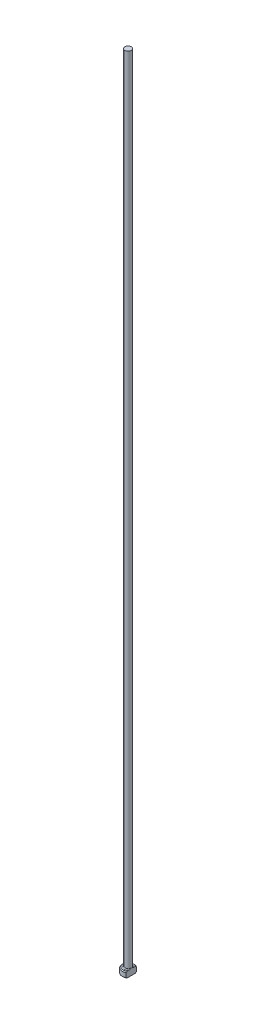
ISO-10303-21;
HEADER;
FILE_DESCRIPTION(('STEP AP214'),'2;1');
FILE_NAME('part.step','',(''),(''),'','','');
FILE_SCHEMA(('AUTOMOTIVE_DESIGN { 1 0 10303 214 1 1 1 1 }'));
ENDSEC;
DATA;
#1=APPLICATION_CONTEXT('core data for automotive mechanical design processes');
#2=APPLICATION_PROTOCOL_DEFINITION('international standard','automotive_design',2000,#1);
#3=PRODUCT_CONTEXT('',#1,'mechanical');
#4=PRODUCT('Part','Part','',(#3));
#5=PRODUCT_RELATED_PRODUCT_CATEGORY('part','',(#4));
#6=PRODUCT_DEFINITION_FORMATION('','',#4);
#7=PRODUCT_DEFINITION_CONTEXT('part definition',#1,'design');
#8=PRODUCT_DEFINITION('design','',#6,#7);
#9=PRODUCT_DEFINITION_SHAPE('','',#8);
#10=(LENGTH_UNIT() NAMED_UNIT(*) SI_UNIT(.MILLI.,.METRE.));
#11=(NAMED_UNIT(*) PLANE_ANGLE_UNIT() SI_UNIT($,.RADIAN.));
#12=(NAMED_UNIT(*) SI_UNIT($,.STERADIAN.) SOLID_ANGLE_UNIT());
#13=UNCERTAINTY_MEASURE_WITH_UNIT(LENGTH_MEASURE(1.E-05),#10,'distance_accuracy_value','');
#14=(GEOMETRIC_REPRESENTATION_CONTEXT(3) GLOBAL_UNCERTAINTY_ASSIGNED_CONTEXT((#13)) GLOBAL_UNIT_ASSIGNED_CONTEXT((#10,
#11,#12)) REPRESENTATION_CONTEXT('',''));
#15=CARTESIAN_POINT('',(0.,0.,0.));
#16=DIRECTION('',(0.,0.,1.));
#17=DIRECTION('',(1.,0.,0.));
#18=AXIS2_PLACEMENT_3D('',#15,#16,#17);
#19=CARTESIAN_POINT('',(0.,0.,0.));
#20=DIRECTION('',(0.,-1.,0.));
#21=DIRECTION('',(0.,0.,-1.));
#22=AXIS2_PLACEMENT_3D('',#19,#20,#21);
#23=PLANE('',#22);
#24=CARTESIAN_POINT('',(0.,0.,0.));
#25=DIRECTION('',(0.,-1.,0.));
#26=DIRECTION('',(0.,0.,-1.));
#27=AXIS2_PLACEMENT_3D('',#24,#25,#26);
#28=CIRCLE('',#27,1.29999999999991);
#29=CARTESIAN_POINT('',(0.799999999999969,0.,1.02469507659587));
#30=VERTEX_POINT('',#29);
#31=CARTESIAN_POINT('',(0.799999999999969,0.,-1.02469507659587));
#32=VERTEX_POINT('',#31);
#33=EDGE_CURVE('E98',#30,#32,#28,.T.);
#34=ORIENTED_EDGE('',*,*,#33,.T.);
#35=DIRECTION('',(0.,0.,1.));
#36=VECTOR('',#35,1.);
#37=CARTESIAN_POINT('',(0.799999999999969,0.,-1.26885775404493));
#38=LINE('',#37,#36);
#39=EDGE_CURVE('E83',#32,#30,#38,.T.);
#40=ORIENTED_EDGE('',*,*,#39,.T.);
#41=EDGE_LOOP('',(#34,#40));
#42=FACE_BOUND('',#41,.T.);
#43=ADVANCED_FACE('F32',(#42),#23,.T.);
#44=CARTESIAN_POINT('',(0.,259.958771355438,0.));
#45=DIRECTION('',(0.,1.,0.));
#46=DIRECTION('',(0.,0.,1.));
#47=AXIS2_PLACEMENT_3D('',#44,#45,#46);
#48=CYLINDRICAL_SURFACE('',#47,1.49999999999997);
#49=CARTESIAN_POINT('',(0.,1.30000000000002,0.));
#50=DIRECTION('',(0.,1.,0.));
#51=DIRECTION('',(0.,0.,1.));
#52=AXIS2_PLACEMENT_3D('',#49,#50,#51);
#53=CIRCLE('',#52,1.49999999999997);
#54=CARTESIAN_POINT('',(0.799999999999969,1.30000000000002,1.26885775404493));
#55=VERTEX_POINT('',#54);
#56=CARTESIAN_POINT('',(0.799999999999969,1.30000000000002,-1.26885775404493));
#57=VERTEX_POINT('',#56);
#58=EDGE_CURVE('E104',#55,#57,#53,.F.);
#59=ORIENTED_EDGE('',*,*,#58,.T.);
#60=DIRECTION('',(0.,-1.,0.));
#61=VECTOR('',#60,1.);
#62=CARTESIAN_POINT('',(0.799999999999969,200.,-1.26885775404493));
#63=LINE('',#62,#61);
#64=CARTESIAN_POINT('',(0.799999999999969,0.200000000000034,-1.26885775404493));
#65=VERTEX_POINT('',#64);
#66=EDGE_CURVE('E183',#57,#65,#63,.T.);
#67=ORIENTED_EDGE('',*,*,#66,.T.);
#68=CARTESIAN_POINT('',(0.,0.200000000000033,0.));
#69=DIRECTION('',(0.,-1.,0.));
#70=DIRECTION('',(0.,0.,-1.));
#71=AXIS2_PLACEMENT_3D('',#68,#69,#70);
#72=CIRCLE('',#71,1.49999999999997);
#73=CARTESIAN_POINT('',(0.799999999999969,0.200000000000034,1.26885775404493));
#74=VERTEX_POINT('',#73);
#75=EDGE_CURVE('E100',#65,#74,#72,.F.);
#76=ORIENTED_EDGE('',*,*,#75,.T.);
#77=DIRECTION('',(0.,-1.,0.));
#78=VECTOR('',#77,1.);
#79=CARTESIAN_POINT('',(0.799999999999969,200.,1.26885775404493));
#80=LINE('',#79,#78);
#81=EDGE_CURVE('E93',#55,#74,#80,.T.);
#82=ORIENTED_EDGE('',*,*,#81,.F.);
#83=EDGE_LOOP('',(#59,#67,#76,#82));
#84=FACE_BOUND('',#83,.T.);
#85=ADVANCED_FACE('F158',(#84),#48,.T.);
#86=CARTESIAN_POINT('',(-1.49999999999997,1.5,0.));
#87=DIRECTION('',(0.,1.,0.));
#88=DIRECTION('',(0.,0.,1.));
#89=AXIS2_PLACEMENT_3D('',#86,#87,#88);
#90=PLANE('',#89);
#91=CARTESIAN_POINT('',(0.,1.5,0.));
#92=DIRECTION('',(0.,1.,0.));
#93=DIRECTION('',(0.,0.,1.));
#94=AXIS2_PLACEMENT_3D('',#91,#92,#93);
#95=CIRCLE('',#94,1.30000000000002);
#96=CARTESIAN_POINT('',(0.799999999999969,1.5,-1.02469507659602));
#97=VERTEX_POINT('',#96);
#98=CARTESIAN_POINT('',(0.799999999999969,1.5,1.02469507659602));
#99=VERTEX_POINT('',#98);
#100=EDGE_CURVE('E178',#97,#99,#95,.T.);
#101=ORIENTED_EDGE('',*,*,#100,.T.);
#102=DIRECTION('',(0.,0.,-1.));
#103=VECTOR('',#102,1.);
#104=CARTESIAN_POINT('',(0.799999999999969,1.5,0.));
#105=LINE('',#104,#103);
#106=CARTESIAN_POINT('',(0.799999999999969,1.49999999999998,0.599999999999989));
#107=VERTEX_POINT('',#106);
#108=EDGE_CURVE('E57',#99,#107,#105,.T.);
#109=ORIENTED_EDGE('',*,*,#108,.T.);
#110=CARTESIAN_POINT('',(0.,1.5,0.));
#111=DIRECTION('',(0.,1.,0.));
#112=DIRECTION('',(0.,0.,1.));
#113=AXIS2_PLACEMENT_3D('',#110,#111,#112);
#114=CIRCLE('',#113,0.999999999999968);
#115=CARTESIAN_POINT('',(0.799999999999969,1.49999999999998,-0.600000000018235));
#116=VERTEX_POINT('',#115);
#117=EDGE_CURVE('E107',#107,#116,#114,.F.);
#118=ORIENTED_EDGE('',*,*,#117,.T.);
#119=EDGE_CURVE('E136',#116,#97,#105,.T.);
#120=ORIENTED_EDGE('',*,*,#119,.T.);
#121=EDGE_LOOP('',(#101,#109,#118,#120));
#122=FACE_BOUND('',#121,.T.);
#123=ADVANCED_FACE('F147',(#122),#90,.T.);
#124=CARTESIAN_POINT('',(0.,1.5,0.));
#125=DIRECTION('',(0.,-1.,0.));
#126=DIRECTION('',(0.,0.,-1.));
#127=AXIS2_PLACEMENT_3D('',#124,#125,#126);
#128=CONICAL_SURFACE('',#127,1.30000000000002,0.785398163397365);
#129=ORIENTED_EDGE('',*,*,#58,.F.);
#130=CARTESIAN_POINT('',(0.799999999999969,-0.108590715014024,2.79640840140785));
#131=CARTESIAN_POINT('',(0.799999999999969,-0.000882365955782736,2.68432462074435));
#132=CARTESIAN_POINT('',(0.799999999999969,0.10662435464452,2.57204275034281));
#133=CARTESIAN_POINT('',(0.799999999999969,0.320918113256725,2.3467291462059));
#134=CARTESIAN_POINT('',(0.799999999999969,0.427704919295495,2.23369719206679));
#135=CARTESIAN_POINT('',(0.799999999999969,0.639300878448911,2.00753337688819));
#136=CARTESIAN_POINT('',(0.799999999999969,0.744119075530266,1.89441000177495));
#137=CARTESIAN_POINT('',(0.799999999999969,0.951972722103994,1.6665588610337));
#138=CARTESIAN_POINT('',(0.799999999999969,1.05500843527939,1.55183133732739));
#139=CARTESIAN_POINT('',(0.799999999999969,1.23161167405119,1.34966755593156));
#140=CARTESIAN_POINT('',(0.799999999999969,1.30589617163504,1.26286366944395));
#141=CARTESIAN_POINT('',(0.799999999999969,1.41524859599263,1.13055151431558));
#142=CARTESIAN_POINT('',(0.799999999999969,1.45144464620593,1.08597829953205));
#143=CARTESIAN_POINT('',(0.799999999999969,1.52278909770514,0.996003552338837));
#144=CARTESIAN_POINT('',(0.799999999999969,1.55793758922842,0.950602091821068));
#145=CARTESIAN_POINT('',(0.799999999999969,1.62707562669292,0.858309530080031));
#146=CARTESIAN_POINT('',(0.799999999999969,1.66105269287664,0.811409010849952));
#147=CARTESIAN_POINT('',(0.799999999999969,1.72689099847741,0.71607032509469));
#148=CARTESIAN_POINT('',(0.799999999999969,1.75875040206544,0.66763087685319));
#149=CARTESIAN_POINT('',(0.799999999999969,1.81908230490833,0.568961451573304));
#150=CARTESIAN_POINT('',(0.799999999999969,1.84757011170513,0.51874102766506));
#151=CARTESIAN_POINT('',(0.799999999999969,1.89949059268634,0.415809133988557));
#152=CARTESIAN_POINT('',(0.799999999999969,1.92293317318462,0.363102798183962));
#153=CARTESIAN_POINT('',(0.799999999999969,1.96197481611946,0.254586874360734));
#154=CARTESIAN_POINT('',(0.799999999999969,1.97756580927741,0.198774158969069));
#155=CARTESIAN_POINT('',(0.799999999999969,1.99243400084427,0.113761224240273));
#156=CARTESIAN_POINT('',(0.799999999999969,1.99597240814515,0.0852975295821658));
#157=CARTESIAN_POINT('',(0.799999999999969,2.00001065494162,0.0281499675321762));
#158=CARTESIAN_POINT('',(0.799999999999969,2.00051084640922,-0.000533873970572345));
#159=CARTESIAN_POINT('',(0.799999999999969,1.99842510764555,-0.0578277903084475));
#160=CARTESIAN_POINT('',(0.799999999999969,1.99583465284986,-0.0864376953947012));
#161=CARTESIAN_POINT('',(0.799999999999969,1.98776318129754,-0.143248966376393));
#162=CARTESIAN_POINT('',(0.799999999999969,1.98228105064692,-0.171450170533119));
#163=CARTESIAN_POINT('',(0.799999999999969,1.96874374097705,-0.227447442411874));
#164=CARTESIAN_POINT('',(0.799999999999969,1.96066903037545,-0.255238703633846));
#165=CARTESIAN_POINT('',(0.799999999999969,1.94239006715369,-0.310100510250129));
#166=CARTESIAN_POINT('',(0.799999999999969,1.93218575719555,-0.33717103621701));
#167=CARTESIAN_POINT('',(0.799999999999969,1.89406620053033,-0.429279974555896));
#168=CARTESIAN_POINT('',(0.799999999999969,1.86189848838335,-0.492545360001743));
#169=CARTESIAN_POINT('',(0.799999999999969,1.79172992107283,-0.615769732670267));
#170=CARTESIAN_POINT('',(0.799999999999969,1.75371426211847,-0.675719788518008));
#171=CARTESIAN_POINT('',(0.799999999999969,1.6737943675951,-0.793878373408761));
#172=CARTESIAN_POINT('',(0.799999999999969,1.6318530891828,-0.852061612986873));
#173=CARTESIAN_POINT('',(0.799999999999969,1.54580257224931,-0.966661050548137));
#174=CARTESIAN_POINT('',(0.799999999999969,1.50169617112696,-1.02307941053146));
#175=CARTESIAN_POINT('',(0.799999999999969,1.39425482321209,-1.15684265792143));
#176=CARTESIAN_POINT('',(0.799999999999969,1.3302231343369,-1.23362537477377));
#177=CARTESIAN_POINT('',(0.799999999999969,1.20042261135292,-1.38571338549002));
#178=CARTESIAN_POINT('',(0.799999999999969,1.13465351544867,-1.46101845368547));
#179=CARTESIAN_POINT('',(0.799999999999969,1.00190865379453,-1.61069142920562));
#180=CARTESIAN_POINT('',(0.799999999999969,0.934931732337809,-1.68505830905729));
#181=CARTESIAN_POINT('',(0.799999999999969,0.80019143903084,-1.83307655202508));
#182=CARTESIAN_POINT('',(0.799999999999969,0.732428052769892,-1.90672790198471));
#183=CARTESIAN_POINT('',(0.799999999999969,0.60062820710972,-2.04887725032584));
#184=CARTESIAN_POINT('',(0.799999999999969,0.536626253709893,-2.11740728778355));
#185=CARTESIAN_POINT('',(0.799999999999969,0.408245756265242,-2.25411608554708));
#186=CARTESIAN_POINT('',(0.799999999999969,0.343867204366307,-2.32229483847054));
#187=CARTESIAN_POINT('',(0.799999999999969,0.214937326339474,-2.45825447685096));
#188=CARTESIAN_POINT('',(0.799999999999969,0.150386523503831,-2.52603585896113));
#189=CARTESIAN_POINT('',(0.799999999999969,0.0210558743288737,-2.66137559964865));
#190=CARTESIAN_POINT('',(0.799999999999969,-0.0437239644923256,-2.72893396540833));
#191=CARTESIAN_POINT('',(0.799999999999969,-0.108590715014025,-2.79640840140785));
#192=B_SPLINE_CURVE_WITH_KNOTS('',3,(#130,#131,#132,#133,#134,#135,#136,#137,#138,#139,#140,
#141,#142,#143,#144,#145,#146,#147,#148,#149,#150,#151,#152,#153,#154,#155,#156,#157,#158,#159,
#160,#161,#162,#163,#164,#165,#166,#167,#168,#169,#170,#171,#172,#173,#174,#175,#176,#177,#178,
#179,#180,#181,#182,#183,#184,#185,#186,#187,#188,#189,#190,#191),.UNSPECIFIED.,.F.,.F.,(4,2,2,
2,2,2,2,2,2,2,2,2,2,2,2,2,2,2,2,2,2,2,2,2,2,2,2,2,2,2,4),(0.,0.466346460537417,
0.932836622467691,1.39548573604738,1.85806581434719,2.2007690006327,2.3730144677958,
2.54524505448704,2.71894834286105,2.89280030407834,3.06582993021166,3.23851664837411,
3.41138048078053,3.49728508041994,3.58317972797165,3.66920027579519,3.75525398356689,
3.84197183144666,3.92869201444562,4.14096510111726,4.35378466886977,4.56886671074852,
4.78367404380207,5.0835611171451,5.38349363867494,5.68373022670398,5.98397232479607,
6.26527738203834,6.54658832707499,6.82739033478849,7.10818320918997),.UNSPECIFIED.);
#193=EDGE_CURVE('E135',#55,#99,#192,.T.);
#194=ORIENTED_EDGE('',*,*,#193,.T.);
#195=ORIENTED_EDGE('',*,*,#100,.F.);
#196=EDGE_CURVE('E127',#97,#57,#192,.T.);
#197=ORIENTED_EDGE('',*,*,#196,.T.);
#198=EDGE_LOOP('',(#129,#194,#195,#197));
#199=FACE_BOUND('',#198,.T.);
#200=ADVANCED_FACE('F143',(#199),#128,.T.);
#201=CARTESIAN_POINT('',(0.,0.200000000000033,0.));
#202=DIRECTION('',(0.,1.,0.));
#203=DIRECTION('',(0.,0.,1.));
#204=AXIS2_PLACEMENT_3D('',#201,#202,#203);
#205=CONICAL_SURFACE('',#204,1.49999999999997,0.785398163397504);
#206=ORIENTED_EDGE('',*,*,#75,.F.);
#207=CARTESIAN_POINT('',(0.799999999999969,1.60859071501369,-2.79640840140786));
#208=CARTESIAN_POINT('',(0.799999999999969,1.50088236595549,-2.68432462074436));
#209=CARTESIAN_POINT('',(0.799999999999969,1.39337564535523,-2.57204275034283));
#210=CARTESIAN_POINT('',(0.799999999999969,1.1790818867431,-2.34672914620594));
#211=CARTESIAN_POINT('',(0.799999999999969,1.07229508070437,-2.23369719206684));
#212=CARTESIAN_POINT('',(0.799999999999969,0.86069912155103,-2.00753337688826));
#213=CARTESIAN_POINT('',(0.799999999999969,0.755880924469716,-1.89441000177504));
#214=CARTESIAN_POINT('',(0.799999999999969,0.54802727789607,-1.66655886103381));
#215=CARTESIAN_POINT('',(0.799999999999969,0.444991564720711,-1.55183133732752));
#216=CARTESIAN_POINT('',(0.799999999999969,0.26838832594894,-1.34966755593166));
#217=CARTESIAN_POINT('',(0.799999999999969,0.194103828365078,-1.26286366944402));
#218=CARTESIAN_POINT('',(0.799999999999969,0.0847514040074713,-1.13055151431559));
#219=CARTESIAN_POINT('',(0.799999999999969,0.048555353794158,-1.08597829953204));
#220=CARTESIAN_POINT('',(0.799999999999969,-0.022789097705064,-0.996003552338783));
#221=CARTESIAN_POINT('',(0.799999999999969,-0.0579375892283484,-0.950602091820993));
#222=CARTESIAN_POINT('',(0.799999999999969,-0.127075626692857,-0.85830953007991));
#223=CARTESIAN_POINT('',(0.799999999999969,-0.16105269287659,-0.811409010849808));
#224=CARTESIAN_POINT('',(0.799999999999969,-0.226890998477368,-0.716070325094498));
#225=CARTESIAN_POINT('',(0.799999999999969,-0.258750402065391,-0.667630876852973));
#226=CARTESIAN_POINT('',(0.799999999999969,-0.319082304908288,-0.568961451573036));
#227=CARTESIAN_POINT('',(0.799999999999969,-0.347570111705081,-0.518741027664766));
#228=CARTESIAN_POINT('',(0.799999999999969,-0.399490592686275,-0.415809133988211));
#229=CARTESIAN_POINT('',(0.799999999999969,-0.422933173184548,-0.363102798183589));
#230=CARTESIAN_POINT('',(0.799999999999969,-0.461974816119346,-0.254586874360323));
#231=CARTESIAN_POINT('',(0.799999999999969,-0.477565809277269,-0.198774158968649));
#232=CARTESIAN_POINT('',(0.799999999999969,-0.492434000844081,-0.113761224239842));
#233=CARTESIAN_POINT('',(0.799999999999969,-0.495972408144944,-0.0852975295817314));
#234=CARTESIAN_POINT('',(0.799999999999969,-0.500010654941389,-0.0281499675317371));
#235=CARTESIAN_POINT('',(0.799999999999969,-0.50051084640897,0.000533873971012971));
#236=CARTESIAN_POINT('',(0.799999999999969,-0.498425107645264,0.0578277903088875));
#237=CARTESIAN_POINT('',(0.799999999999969,-0.495834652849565,0.0864376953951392));
#238=CARTESIAN_POINT('',(0.799999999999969,-0.48776318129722,0.143248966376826));
#239=CARTESIAN_POINT('',(0.799999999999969,-0.482281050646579,0.17145017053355));
#240=CARTESIAN_POINT('',(0.799999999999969,-0.468743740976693,0.227447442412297));
#241=CARTESIAN_POINT('',(0.799999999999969,-0.460669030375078,0.255238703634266));
#242=CARTESIAN_POINT('',(0.799999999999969,-0.442390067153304,0.310100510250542));
#243=CARTESIAN_POINT('',(0.799999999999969,-0.43218575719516,0.33717103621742));
#244=CARTESIAN_POINT('',(0.799999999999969,-0.394066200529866,0.429279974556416));
#245=CARTESIAN_POINT('',(0.799999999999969,-0.361898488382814,0.492545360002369));
#246=CARTESIAN_POINT('',(0.799999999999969,-0.291729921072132,0.615769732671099));
#247=CARTESIAN_POINT('',(0.799999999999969,-0.253714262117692,0.675719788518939));
#248=CARTESIAN_POINT('',(0.799999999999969,-0.173794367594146,0.793878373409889));
#249=CARTESIAN_POINT('',(0.799999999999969,-0.131853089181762,0.852061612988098));
#250=CARTESIAN_POINT('',(0.799999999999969,-0.0458025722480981,0.966661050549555));
#251=CARTESIAN_POINT('',(0.799999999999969,-0.00169617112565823,1.02307941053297));
#252=CARTESIAN_POINT('',(0.799999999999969,0.105745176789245,1.15684265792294));
#253=CARTESIAN_POINT('',(0.799999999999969,0.169776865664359,1.2336253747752));
#254=CARTESIAN_POINT('',(0.799999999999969,0.2995773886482,1.38571338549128));
#255=CARTESIAN_POINT('',(0.799999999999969,0.365346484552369,1.46101845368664));
#256=CARTESIAN_POINT('',(0.799999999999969,0.498091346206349,1.61069142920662));
#257=CARTESIAN_POINT('',(0.799999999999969,0.565068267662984,1.68505830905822));
#258=CARTESIAN_POINT('',(0.799999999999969,0.699808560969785,1.83307655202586));
#259=CARTESIAN_POINT('',(0.799999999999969,0.767571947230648,1.9067279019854));
#260=CARTESIAN_POINT('',(0.799999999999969,0.899371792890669,2.04887725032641));
#261=CARTESIAN_POINT('',(0.799999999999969,0.963373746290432,2.11740728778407));
#262=CARTESIAN_POINT('',(0.799999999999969,1.09175424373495,2.25411608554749));
#263=CARTESIAN_POINT('',(0.799999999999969,1.15613279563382,2.3222948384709));
#264=CARTESIAN_POINT('',(0.799999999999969,1.28506267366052,2.45825447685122));
#265=CARTESIAN_POINT('',(0.799999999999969,1.3496134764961,2.52603585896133));
#266=CARTESIAN_POINT('',(0.799999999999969,1.47894412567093,2.66137559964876));
#267=CARTESIAN_POINT('',(0.799999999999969,1.54372396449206,2.72893396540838));
#268=CARTESIAN_POINT('',(0.799999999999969,1.60859071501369,2.79640840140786));
#269=B_SPLINE_CURVE_WITH_KNOTS('',3,(#207,#208,#209,#210,#211,#212,#213,#214,#215,#216,#217,
#218,#219,#220,#221,#222,#223,#224,#225,#226,#227,#228,#229,#230,#231,#232,#233,#234,#235,#236,
#237,#238,#239,#240,#241,#242,#243,#244,#245,#246,#247,#248,#249,#250,#251,#252,#253,#254,#255,
#256,#257,#258,#259,#260,#261,#262,#263,#264,#265,#266,#267,#268),.UNSPECIFIED.,.F.,.F.,(4,2,2,
2,2,2,2,2,2,2,2,2,2,2,2,2,2,2,2,2,2,2,2,2,2,2,2,2,2,2,4),(0.,0.466346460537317,
0.932836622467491,1.39548573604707,1.85806581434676,2.20076900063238,2.37301446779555,
2.54524505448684,2.71894834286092,2.89280030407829,3.06582993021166,3.23851664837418,
3.4113804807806,3.49728508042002,3.58317972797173,3.66920027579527,3.75525398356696,
3.84197183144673,3.92869201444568,4.14096510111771,4.35378466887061,4.56886671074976,
4.78367404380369,5.08356111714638,5.38349363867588,5.68373022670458,5.98397232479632,
6.26527738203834,6.54658832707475,6.827390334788,7.10818320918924),.UNSPECIFIED.);
#270=EDGE_CURVE('E86',#65,#32,#269,.T.);
#271=ORIENTED_EDGE('',*,*,#270,.T.);
#272=ORIENTED_EDGE('',*,*,#33,.F.);
#273=EDGE_CURVE('E89',#30,#74,#269,.T.);
#274=ORIENTED_EDGE('',*,*,#273,.T.);
#275=EDGE_LOOP('',(#206,#271,#272,#274));
#276=FACE_BOUND('',#275,.T.);
#277=ADVANCED_FACE('F97',(#276),#205,.T.);
#278=CARTESIAN_POINT('',(0.,1.69999999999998,0.));
#279=DIRECTION('',(0.,1.,0.));
#280=DIRECTION('',(0.,0.,1.));
#281=AXIS2_PLACEMENT_3D('',#278,#279,#280);
#282=TOROIDAL_SURFACE('',#281,0.999999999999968,0.2);
#283=CARTESIAN_POINT('',(0.799999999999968,1.69999999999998,0.));
#284=CARTESIAN_POINT('',(0.799999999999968,1.70000052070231,-1.07740569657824E-10));
#285=CARTESIAN_POINT('',(0.799999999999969,1.70000104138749,-8.25850860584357E-08));
#286=CARTESIAN_POINT('',(0.799999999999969,1.7000020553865,-3.57496578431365E-07));
#287=CARTESIAN_POINT('',(0.799999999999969,1.7000025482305,-5.51414205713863E-07));
#288=CARTESIAN_POINT('',(0.799999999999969,1.70000352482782,-1.02256682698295E-06));
#289=CARTESIAN_POINT('',(0.799999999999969,1.70000400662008,-1.30376835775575E-06));
#290=CARTESIAN_POINT('',(0.799999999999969,1.7000049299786,-1.92036681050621E-06));
#291=CARTESIAN_POINT('',(0.799999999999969,1.70000537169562,-2.25554622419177E-06));
#292=CARTESIAN_POINT('',(0.799999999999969,1.70000679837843,-3.42582461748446E-06));
#293=CARTESIAN_POINT('',(0.799999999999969,1.7000077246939,-4.33303061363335E-06));
#294=CARTESIAN_POINT('',(0.799999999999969,1.70000942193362,-6.24182407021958E-06));
#295=CARTESIAN_POINT('',(0.799999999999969,1.70001019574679,-7.24099037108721E-06));
#296=CARTESIAN_POINT('',(0.799999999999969,1.70001296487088,-1.10006264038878E-05));
#297=CARTESIAN_POINT('',(0.799999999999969,1.70001480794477,-1.38764659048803E-05));
#298=CARTESIAN_POINT('',(0.799999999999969,1.70001794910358,-1.96579256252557E-05));
#299=CARTESIAN_POINT('',(0.799999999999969,1.70001927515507,-2.25490182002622E-05));
#300=CARTESIAN_POINT('',(0.799999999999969,1.70002465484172,-3.44465536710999E-05));
#301=CARTESIAN_POINT('',(0.799999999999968,1.70002857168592,-4.35098174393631E-05));
#302=CARTESIAN_POINT('',(0.799999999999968,1.70003510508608,-6.07223717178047E-05));
#303=CARTESIAN_POINT('',(0.799999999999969,1.70003782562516,-6.88309361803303E-05));
#304=CARTESIAN_POINT('',(0.799999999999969,1.70005864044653,-0.000125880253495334));
#305=CARTESIAN_POINT('',(0.799999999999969,1.70008424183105,-0.000171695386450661));
#306=CARTESIAN_POINT('',(0.799999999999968,1.70017855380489,-0.00034720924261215));
#307=CARTESIAN_POINT('',(0.799999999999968,1.70024169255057,-0.000479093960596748));
#308=CARTESIAN_POINT('',(0.799999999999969,1.70048616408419,-0.000981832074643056));
#309=CARTESIAN_POINT('',(0.799999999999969,1.70067331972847,-0.00135043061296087));
#310=CARTESIAN_POINT('',(0.799999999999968,1.70142117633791,-0.00283094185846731));
#311=CARTESIAN_POINT('',(0.799999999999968,1.70197535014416,-0.00394535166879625));
#312=CARTESIAN_POINT('',(0.799999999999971,1.71061058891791,-0.0213011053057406));
#313=CARTESIAN_POINT('',(0.799999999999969,1.71874400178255,-0.0375230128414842));
#314=CARTESIAN_POINT('',(0.799999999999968,1.73460832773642,-0.0694811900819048));
#315=CARTESIAN_POINT('',(0.799999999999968,1.74234357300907,-0.0852154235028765));
#316=CARTESIAN_POINT('',(0.799999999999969,1.75846316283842,-0.118454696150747));
#317=CARTESIAN_POINT('',(0.799999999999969,1.7668284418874,-0.135969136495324));
#318=CARTESIAN_POINT('',(0.799999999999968,1.78329738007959,-0.171319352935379));
#319=CARTESIAN_POINT('',(0.799999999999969,1.79139788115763,-0.189156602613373));
#320=CARTESIAN_POINT('',(0.799999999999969,1.81123303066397,-0.234404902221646));
#321=CARTESIAN_POINT('',(0.799999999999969,1.82265785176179,-0.261953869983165));
#322=CARTESIAN_POINT('',(0.799999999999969,1.84367616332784,-0.31710366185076));
#323=CARTESIAN_POINT('',(0.799999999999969,1.85330270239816,-0.344691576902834));
#324=CARTESIAN_POINT('',(0.799999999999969,1.86619221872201,-0.38675392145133));
#325=CARTESIAN_POINT('',(0.799999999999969,1.87025173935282,-0.400983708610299));
#326=CARTESIAN_POINT('',(0.799999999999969,1.87774404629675,-0.429670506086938));
#327=CARTESIAN_POINT('',(0.799999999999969,1.8811740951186,-0.44412822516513));
#328=CARTESIAN_POINT('',(0.799999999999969,1.89063941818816,-0.489163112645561));
#329=CARTESIAN_POINT('',(0.799999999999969,1.89540671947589,-0.520030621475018));
#330=CARTESIAN_POINT('',(0.799999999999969,1.90049267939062,-0.58212622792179));
#331=CARTESIAN_POINT('',(0.799999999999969,1.90081735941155,-0.613353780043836));
#332=CARTESIAN_POINT('',(0.799999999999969,1.89549709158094,-0.674915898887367));
#333=CARTESIAN_POINT('',(0.799999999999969,1.88995916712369,-0.705256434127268));
#334=CARTESIAN_POINT('',(0.799999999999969,1.8763682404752,-0.747474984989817));
#335=CARTESIAN_POINT('',(0.799999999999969,1.8713676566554,-0.760339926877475));
#336=CARTESIAN_POINT('',(0.799999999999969,1.85959942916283,-0.785299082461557));
#337=CARTESIAN_POINT('',(0.799999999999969,1.85282697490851,-0.79739108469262));
#338=CARTESIAN_POINT('',(0.799999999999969,1.83727733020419,-0.820446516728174));
#339=CARTESIAN_POINT('',(0.799999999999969,1.82847700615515,-0.831394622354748));
#340=CARTESIAN_POINT('',(0.799999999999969,1.80887943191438,-0.851318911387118));
#341=CARTESIAN_POINT('',(0.799999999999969,1.79808937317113,-0.860301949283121));
#342=CARTESIAN_POINT('',(0.799999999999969,1.77879935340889,-0.872872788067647));
#343=CARTESIAN_POINT('',(0.799999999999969,1.77081074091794,-0.877249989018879));
#344=CARTESIAN_POINT('',(0.799999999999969,1.75421627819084,-0.884624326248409));
#345=CARTESIAN_POINT('',(0.799999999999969,1.74561080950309,-0.887622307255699));
#346=CARTESIAN_POINT('',(0.799999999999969,1.72796171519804,-0.892065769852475));
#347=CARTESIAN_POINT('',(0.799999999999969,1.7189162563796,-0.893504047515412));
#348=CARTESIAN_POINT('',(0.799999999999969,1.70071433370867,-0.894703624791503));
#349=CARTESIAN_POINT('',(0.799999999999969,1.69155789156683,-0.894465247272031));
#350=CARTESIAN_POINT('',(0.799999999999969,1.67411305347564,-0.892409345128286));
#351=CARTESIAN_POINT('',(0.799999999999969,1.66581040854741,-0.890709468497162));
#352=CARTESIAN_POINT('',(0.799999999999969,1.64959326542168,-0.885987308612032));
#353=CARTESIAN_POINT('',(0.799999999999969,1.64167879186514,-0.882964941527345));
#354=CARTESIAN_POINT('',(0.799999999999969,1.62612521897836,-0.875619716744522));
#355=CARTESIAN_POINT('',(0.799999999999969,1.6185069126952,-0.871253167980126));
#356=CARTESIAN_POINT('',(0.799999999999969,1.60398538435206,-0.861466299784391));
#357=CARTESIAN_POINT('',(0.799999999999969,1.59708247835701,-0.856045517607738));
#358=CARTESIAN_POINT('',(0.799999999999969,1.58115991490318,-0.841751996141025));
#359=CARTESIAN_POINT('',(0.799999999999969,1.57255696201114,-0.832413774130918));
#360=CARTESIAN_POINT('',(0.799999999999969,1.5569709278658,-0.812463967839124));
#361=CARTESIAN_POINT('',(0.799999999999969,1.54999208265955,-0.80184916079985));
#362=CARTESIAN_POINT('',(0.799999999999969,1.53507995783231,-0.775315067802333));
#363=CARTESIAN_POINT('',(0.799999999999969,1.52789105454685,-0.758978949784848));
#364=CARTESIAN_POINT('',(0.799999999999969,1.51619194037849,-0.72544267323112));
#365=CARTESIAN_POINT('',(0.799999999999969,1.51167841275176,-0.708243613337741));
#366=CARTESIAN_POINT('',(0.799999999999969,1.50308125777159,-0.664008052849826));
#367=CARTESIAN_POINT('',(0.799999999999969,1.50054575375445,-0.636674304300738));
#368=CARTESIAN_POINT('',(0.799999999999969,1.49960545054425,-0.581571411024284));
#369=CARTESIAN_POINT('',(0.799999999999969,1.50126887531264,-0.553802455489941));
#370=CARTESIAN_POINT('',(0.799999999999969,1.51076969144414,-0.474087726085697));
#371=CARTESIAN_POINT('',(0.799999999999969,1.52278886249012,-0.422656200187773));
#372=CARTESIAN_POINT('',(0.799999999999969,1.54542054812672,-0.348884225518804));
#373=CARTESIAN_POINT('',(0.799999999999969,1.553391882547,-0.325596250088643));
#374=CARTESIAN_POINT('',(0.799999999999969,1.57044260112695,-0.279605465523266));
#375=CARTESIAN_POINT('',(0.799999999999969,1.5795136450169,-0.256899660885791));
#376=CARTESIAN_POINT('',(0.799999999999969,1.59612615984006,-0.217481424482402));
#377=CARTESIAN_POINT('',(0.799999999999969,1.60348346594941,-0.200689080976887));
#378=CARTESIAN_POINT('',(0.799999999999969,1.61873273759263,-0.16689025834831));
#379=CARTESIAN_POINT('',(0.799999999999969,1.62663303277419,-0.1498875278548));
#380=CARTESIAN_POINT('',(0.799999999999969,1.64000428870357,-0.12169659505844));
#381=CARTESIAN_POINT('',(0.799999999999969,1.64540046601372,-0.110472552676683));
#382=CARTESIAN_POINT('',(0.799999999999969,1.65623294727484,-0.088168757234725));
#383=CARTESIAN_POINT('',(0.799999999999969,1.66166844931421,-0.0770886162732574));
#384=CARTESIAN_POINT('',(0.799999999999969,1.67206713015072,-0.0560154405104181));
#385=CARTESIAN_POINT('',(0.799999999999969,1.67702562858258,-0.0460200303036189));
#386=CARTESIAN_POINT('',(0.799999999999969,1.68715625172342,-0.0257066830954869));
#387=CARTESIAN_POINT('',(0.799999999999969,1.69232987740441,-0.0153894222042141));
#388=CARTESIAN_POINT('',(0.799999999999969,1.69802413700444,-0.00394656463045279));
#389=CARTESIAN_POINT('',(0.799999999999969,1.69857766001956,-0.00283331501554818));
#390=CARTESIAN_POINT('',(0.799999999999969,1.69932534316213,-0.00135310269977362));
#391=CARTESIAN_POINT('',(0.799999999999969,1.69951294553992,-0.000983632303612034));
#392=CARTESIAN_POINT('',(0.799999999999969,1.69975796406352,-0.000479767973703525));
#393=CARTESIAN_POINT('',(0.799999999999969,1.69982122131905,-0.000347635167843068));
#394=CARTESIAN_POINT('',(0.799999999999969,1.69991569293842,-0.000171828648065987));
#395=CARTESIAN_POINT('',(0.799999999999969,1.69994132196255,-0.000125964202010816));
#396=CARTESIAN_POINT('',(0.799999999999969,1.69996215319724,-6.88565605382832E-05));
#397=CARTESIAN_POINT('',(0.799999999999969,1.69996487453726,-6.07436450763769E-05));
#398=CARTESIAN_POINT('',(0.799999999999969,1.69997141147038,-4.35218238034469E-05));
#399=CARTESIAN_POINT('',(0.799999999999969,1.69997533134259,-3.44537566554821E-05));
#400=CARTESIAN_POINT('',(0.799999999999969,1.69998071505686,-2.25508109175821E-05));
#401=CARTESIAN_POINT('',(0.799999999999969,1.69998204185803,-1.96589688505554E-05));
#402=CARTESIAN_POINT('',(0.799999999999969,1.69998518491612,-1.38761465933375E-05));
#403=CARTESIAN_POINT('',(0.799999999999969,1.69998702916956,-1.09997147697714E-05));
#404=CARTESIAN_POINT('',(0.799999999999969,1.6999897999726,-7.23954686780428E-06));
#405=CARTESIAN_POINT('',(0.799999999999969,1.6999905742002,-6.24031831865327E-06));
#406=CARTESIAN_POINT('',(0.799999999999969,1.69999227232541,-4.33148565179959E-06));
#407=CARTESIAN_POINT('',(0.799999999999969,1.69999319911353,-3.4243052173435E-06));
#408=CARTESIAN_POINT('',(0.799999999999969,1.69999462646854,-2.25416419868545E-06));
#409=CARTESIAN_POINT('',(0.799999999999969,1.69999506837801,-1.9190446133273E-06));
#410=CARTESIAN_POINT('',(0.799999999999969,1.69999599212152,-1.30259970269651E-06));
#411=CARTESIAN_POINT('',(0.799999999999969,1.69999647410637,-1.02149208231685E-06));
#412=CARTESIAN_POINT('',(0.799999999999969,1.69999745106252,-5.50567949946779E-07));
#413=CARTESIAN_POINT('',(0.799999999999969,1.69999794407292,-3.56781844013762E-07));
#414=CARTESIAN_POINT('',(0.799999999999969,1.69999895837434,-8.21863285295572E-08));
#415=CARTESIAN_POINT('',(0.799999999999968,1.69999947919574,1.07761657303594E-10));
#416=CARTESIAN_POINT('',(0.799999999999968,1.69999999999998,0.));
#417=B_SPLINE_CURVE_WITH_KNOTS('',3,(#283,#284,#285,#286,#287,#288,#289,#290,#291,#292,#293,
#294,#295,#296,#297,#298,#299,#300,#301,#302,#303,#304,#305,#306,#307,#308,#309,#310,#311,#312,
#313,#314,#315,#316,#317,#318,#319,#320,#321,#322,#323,#324,#325,#326,#327,#328,#329,#330,#331,
#332,#333,#334,#335,#336,#337,#338,#339,#340,#341,#342,#343,#344,#345,#346,#347,#348,#349,#350,
#351,#352,#353,#354,#355,#356,#357,#358,#359,#360,#361,#362,#363,#364,#365,#366,#367,#368,#369,
#370,#371,#372,#373,#374,#375,#376,#377,#378,#379,#380,#381,#382,#383,#384,#385,#386,#387,#388,
#389,#390,#391,#392,#393,#394,#395,#396,#397,#398,#399,#400,#401,#402,#403,#404,#405,#406,#407,
#408,#409,#410,#411,#412,#413,#414,#415,#416),.UNSPECIFIED.,.T.,.F.,(4,2,2,2,2,2,2,2,2,2,2,2,2,
2,2,2,2,2,2,2,2,2,2,2,2,2,2,2,2,2,2,2,2,2,2,2,2,2,2,2,2,2,2,2,2,2,2,2,2,2,2,2,2,2,2,2,2,2,2,2,2,
2,2,2,2,2,4),(0.,1.56041509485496E-06,3.14209997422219E-06,4.81003054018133E-06,
6.4714008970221E-06,1.03419149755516E-05,1.41300090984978E-05,2.43375473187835E-05,
3.38705168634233E-05,6.34790223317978E-05,8.91110433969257E-05,0.0002457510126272,
0.000685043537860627,0.00192443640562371,0.00565901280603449,0.0600913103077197,
0.112691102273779,0.170916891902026,0.229684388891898,0.319123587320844,0.406709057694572,
0.451087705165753,0.495654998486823,0.589095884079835,0.682410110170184,0.774049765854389,
0.815352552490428,0.856768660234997,0.898682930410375,0.940448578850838,0.967667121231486,
0.994868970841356,1.02219593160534,1.04951763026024,1.07482622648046,1.10013642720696,
1.12637630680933,1.15262773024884,1.19050680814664,1.22848360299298,1.28172910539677,
1.33490845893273,1.41680298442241,1.50003666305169,1.65746622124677,1.73131208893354,
1.80462934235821,1.85962660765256,1.91586794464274,1.95322923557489,1.990253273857,
2.02372755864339,2.05834809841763,2.06207870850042,2.06332103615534,2.06376115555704,
2.06391796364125,2.06394360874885,2.06397323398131,2.06398276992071,2.06399298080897,
2.06399676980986,2.06400064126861,2.06400230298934,2.06400397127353,2.0640055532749,
2.06400711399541),.UNSPECIFIED.);
#418=CARTESIAN_POINT('',(0.799999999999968,1.69999999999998,0.));
#419=VERTEX_POINT('',#418);
#420=EDGE_CURVE('E11',#116,#419,#417,.T.);
#421=ORIENTED_EDGE('',*,*,#420,.F.);
#422=ORIENTED_EDGE('',*,*,#117,.F.);
#423=CARTESIAN_POINT('',(0.799999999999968,1.69999999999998,0.));
#424=CARTESIAN_POINT('',(0.799999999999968,1.69999947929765,1.07740575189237E-10));
#425=CARTESIAN_POINT('',(0.799999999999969,1.69999895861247,8.25850860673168E-08));
#426=CARTESIAN_POINT('',(0.799999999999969,1.69999794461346,3.5749657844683E-07));
#427=CARTESIAN_POINT('',(0.799999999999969,1.69999745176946,5.51414205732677E-07));
#428=CARTESIAN_POINT('',(0.799999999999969,1.69999647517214,1.02256682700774E-06));
#429=CARTESIAN_POINT('',(0.799999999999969,1.69999599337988,1.30376835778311E-06));
#430=CARTESIAN_POINT('',(0.799999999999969,1.69999507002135,1.9203668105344E-06));
#431=CARTESIAN_POINT('',(0.799999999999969,1.69999462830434,2.25554622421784E-06));
#432=CARTESIAN_POINT('',(0.799999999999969,1.69999320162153,3.42582461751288E-06));
#433=CARTESIAN_POINT('',(0.799999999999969,1.69999227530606,4.33303061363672E-06));
#434=CARTESIAN_POINT('',(0.799999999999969,1.69999057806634,6.2418240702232E-06));
#435=CARTESIAN_POINT('',(0.799999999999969,1.69998980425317,7.24099037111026E-06));
#436=CARTESIAN_POINT('',(0.799999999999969,1.69998703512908,1.10006264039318E-05));
#437=CARTESIAN_POINT('',(0.799999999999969,1.69998519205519,1.38764659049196E-05));
#438=CARTESIAN_POINT('',(0.799999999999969,1.69998205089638,1.96579256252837E-05));
#439=CARTESIAN_POINT('',(0.799999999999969,1.69998072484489,2.25490182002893E-05));
#440=CARTESIAN_POINT('',(0.799999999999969,1.69997534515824,3.44465536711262E-05));
#441=CARTESIAN_POINT('',(0.799999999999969,1.69997142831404,4.35098174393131E-05));
#442=CARTESIAN_POINT('',(0.799999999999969,1.69996489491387,6.07223717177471E-05));
#443=CARTESIAN_POINT('',(0.799999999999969,1.6999621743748,6.88309361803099E-05));
#444=CARTESIAN_POINT('',(0.799999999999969,1.69994135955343,0.000125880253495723));
#445=CARTESIAN_POINT('',(0.799999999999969,1.69991575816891,0.000171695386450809));
#446=CARTESIAN_POINT('',(0.799999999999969,1.69982144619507,0.00034720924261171));
#447=CARTESIAN_POINT('',(0.799999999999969,1.69975830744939,0.000479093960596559));
#448=CARTESIAN_POINT('',(0.799999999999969,1.69951383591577,0.000981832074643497));
#449=CARTESIAN_POINT('',(0.799999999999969,1.69932668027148,0.00135043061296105));
#450=CARTESIAN_POINT('',(0.799999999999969,1.69857882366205,0.00283094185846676));
#451=CARTESIAN_POINT('',(0.799999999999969,1.6980246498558,0.00394535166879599));
#452=CARTESIAN_POINT('',(0.799999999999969,1.68938941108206,0.0213011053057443));
#453=CARTESIAN_POINT('',(0.799999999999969,1.68125599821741,0.0375230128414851));
#454=CARTESIAN_POINT('',(0.799999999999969,1.66539167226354,0.0694811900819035));
#455=CARTESIAN_POINT('',(0.799999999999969,1.65765642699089,0.0852154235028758));
#456=CARTESIAN_POINT('',(0.799999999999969,1.64153683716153,0.118454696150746));
#457=CARTESIAN_POINT('',(0.799999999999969,1.63317155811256,0.135969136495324));
#458=CARTESIAN_POINT('',(0.799999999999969,1.61670261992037,0.171319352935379));
#459=CARTESIAN_POINT('',(0.799999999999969,1.60860211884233,0.189156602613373));
#460=CARTESIAN_POINT('',(0.799999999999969,1.58876696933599,0.234404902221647));
#461=CARTESIAN_POINT('',(0.799999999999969,1.57734214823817,0.261953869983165));
#462=CARTESIAN_POINT('',(0.799999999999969,1.55632383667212,0.31710366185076));
#463=CARTESIAN_POINT('',(0.799999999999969,1.5466972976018,0.344691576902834));
#464=CARTESIAN_POINT('',(0.799999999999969,1.53380778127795,0.38675392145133));
#465=CARTESIAN_POINT('',(0.799999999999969,1.52974826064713,0.400983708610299));
#466=CARTESIAN_POINT('',(0.799999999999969,1.52225595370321,0.429670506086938));
#467=CARTESIAN_POINT('',(0.799999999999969,1.51882590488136,0.44412822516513));
#468=CARTESIAN_POINT('',(0.799999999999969,1.5093605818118,0.489163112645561));
#469=CARTESIAN_POINT('',(0.799999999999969,1.50459328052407,0.520030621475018));
#470=CARTESIAN_POINT('',(0.799999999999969,1.49950732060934,0.58212622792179));
#471=CARTESIAN_POINT('',(0.799999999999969,1.49918264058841,0.613353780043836));
#472=CARTESIAN_POINT('',(0.799999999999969,1.50450290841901,0.674915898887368));
#473=CARTESIAN_POINT('',(0.799999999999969,1.51004083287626,0.705256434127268));
#474=CARTESIAN_POINT('',(0.799999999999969,1.52363175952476,0.747474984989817));
#475=CARTESIAN_POINT('',(0.799999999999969,1.52863234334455,0.760339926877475));
#476=CARTESIAN_POINT('',(0.799999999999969,1.54040057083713,0.785299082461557));
#477=CARTESIAN_POINT('',(0.799999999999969,1.54717302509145,0.79739108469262));
#478=CARTESIAN_POINT('',(0.799999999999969,1.56272266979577,0.820446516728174));
#479=CARTESIAN_POINT('',(0.799999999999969,1.57152299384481,0.831394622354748));
#480=CARTESIAN_POINT('',(0.799999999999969,1.59112056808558,0.851318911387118));
#481=CARTESIAN_POINT('',(0.799999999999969,1.60191062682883,0.860301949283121));
#482=CARTESIAN_POINT('',(0.799999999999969,1.62120064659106,0.872872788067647));
#483=CARTESIAN_POINT('',(0.799999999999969,1.62918925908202,0.877249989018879));
#484=CARTESIAN_POINT('',(0.799999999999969,1.64578372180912,0.884624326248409));
#485=CARTESIAN_POINT('',(0.799999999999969,1.65438919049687,0.887622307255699));
#486=CARTESIAN_POINT('',(0.799999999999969,1.67203828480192,0.892065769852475));
#487=CARTESIAN_POINT('',(0.799999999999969,1.68108374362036,0.893504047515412));
#488=CARTESIAN_POINT('',(0.799999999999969,1.69928566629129,0.894703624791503));
#489=CARTESIAN_POINT('',(0.799999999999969,1.70844210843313,0.894465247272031));
#490=CARTESIAN_POINT('',(0.799999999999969,1.72588694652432,0.892409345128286));
#491=CARTESIAN_POINT('',(0.799999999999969,1.73418959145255,0.890709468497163));
#492=CARTESIAN_POINT('',(0.799999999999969,1.75040673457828,0.885987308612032));
#493=CARTESIAN_POINT('',(0.799999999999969,1.75832120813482,0.882964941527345));
#494=CARTESIAN_POINT('',(0.799999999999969,1.7738747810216,0.875619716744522));
#495=CARTESIAN_POINT('',(0.799999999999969,1.78149308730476,0.871253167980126));
#496=CARTESIAN_POINT('',(0.799999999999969,1.79601461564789,0.861466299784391));
#497=CARTESIAN_POINT('',(0.799999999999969,1.80291752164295,0.856045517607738));
#498=CARTESIAN_POINT('',(0.799999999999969,1.81884008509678,0.841751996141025));
#499=CARTESIAN_POINT('',(0.799999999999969,1.82744303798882,0.832413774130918));
#500=CARTESIAN_POINT('',(0.799999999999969,1.84302907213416,0.812463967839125));
#501=CARTESIAN_POINT('',(0.799999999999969,1.85000791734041,0.801849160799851));
#502=CARTESIAN_POINT('',(0.799999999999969,1.86492004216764,0.775315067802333));
#503=CARTESIAN_POINT('',(0.799999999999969,1.87210894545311,0.758978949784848));
#504=CARTESIAN_POINT('',(0.799999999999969,1.88380805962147,0.725442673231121));
#505=CARTESIAN_POINT('',(0.799999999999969,1.8883215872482,0.708243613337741));
#506=CARTESIAN_POINT('',(0.799999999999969,1.89691874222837,0.664008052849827));
#507=CARTESIAN_POINT('',(0.799999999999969,1.8994542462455,0.636674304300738));
#508=CARTESIAN_POINT('',(0.799999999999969,1.9003945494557,0.581571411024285));
#509=CARTESIAN_POINT('',(0.799999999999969,1.89873112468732,0.553802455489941));
#510=CARTESIAN_POINT('',(0.799999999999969,1.88923030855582,0.474087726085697));
#511=CARTESIAN_POINT('',(0.799999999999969,1.87721113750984,0.422656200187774));
#512=CARTESIAN_POINT('',(0.799999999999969,1.85457945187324,0.348884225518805));
#513=CARTESIAN_POINT('',(0.799999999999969,1.84660811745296,0.325596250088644));
#514=CARTESIAN_POINT('',(0.799999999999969,1.82955739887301,0.279605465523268));
#515=CARTESIAN_POINT('',(0.799999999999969,1.82048635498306,0.256899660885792));
#516=CARTESIAN_POINT('',(0.799999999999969,1.8038738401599,0.217481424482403));
#517=CARTESIAN_POINT('',(0.799999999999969,1.79651653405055,0.200689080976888));
#518=CARTESIAN_POINT('',(0.799999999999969,1.78126726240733,0.166890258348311));
#519=CARTESIAN_POINT('',(0.799999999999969,1.77336696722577,0.149887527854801));
#520=CARTESIAN_POINT('',(0.799999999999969,1.75999571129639,0.121696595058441));
#521=CARTESIAN_POINT('',(0.799999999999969,1.75459953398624,0.110472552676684));
#522=CARTESIAN_POINT('',(0.799999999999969,1.74376705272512,0.0881687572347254));
#523=CARTESIAN_POINT('',(0.799999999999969,1.73833155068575,0.0770886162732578));
#524=CARTESIAN_POINT('',(0.799999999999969,1.72793286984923,0.0560154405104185));
#525=CARTESIAN_POINT('',(0.799999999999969,1.72297437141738,0.0460200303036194));
#526=CARTESIAN_POINT('',(0.799999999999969,1.71284374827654,0.0257066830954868));
#527=CARTESIAN_POINT('',(0.799999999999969,1.70767012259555,0.0153894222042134));
#528=CARTESIAN_POINT('',(0.799999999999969,1.70197586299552,0.00394656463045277));
#529=CARTESIAN_POINT('',(0.799999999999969,1.7014223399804,0.00283331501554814));
#530=CARTESIAN_POINT('',(0.799999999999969,1.70067465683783,0.00135310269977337));
#531=CARTESIAN_POINT('',(0.799999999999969,1.70048705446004,0.000983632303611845));
#532=CARTESIAN_POINT('',(0.799999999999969,1.70024203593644,0.000479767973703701));
#533=CARTESIAN_POINT('',(0.799999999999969,1.7001787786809,0.000347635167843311));
#534=CARTESIAN_POINT('',(0.799999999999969,1.70008430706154,0.00017182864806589));
#535=CARTESIAN_POINT('',(0.799999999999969,1.70005867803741,0.000125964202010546));
#536=CARTESIAN_POINT('',(0.799999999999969,1.70003784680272,6.88565605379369E-05));
#537=CARTESIAN_POINT('',(0.799999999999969,1.7000351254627,6.07436450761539E-05));
#538=CARTESIAN_POINT('',(0.799999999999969,1.70002858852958,4.35218238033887E-05));
#539=CARTESIAN_POINT('',(0.799999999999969,1.70002466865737,3.44537566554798E-05));
#540=CARTESIAN_POINT('',(0.799999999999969,1.7000192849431,2.2550810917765E-05));
#541=CARTESIAN_POINT('',(0.799999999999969,1.70001795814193,1.96589688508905E-05));
#542=CARTESIAN_POINT('',(0.799999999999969,1.70001481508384,1.38761465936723E-05));
#543=CARTESIAN_POINT('',(0.799999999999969,1.7000129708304,1.09997147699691E-05));
#544=CARTESIAN_POINT('',(0.799999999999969,1.70001020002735,7.23954686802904E-06));
#545=CARTESIAN_POINT('',(0.799999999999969,1.70000942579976,6.2403183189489E-06));
#546=CARTESIAN_POINT('',(0.799999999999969,1.70000772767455,4.33148565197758E-06));
#547=CARTESIAN_POINT('',(0.799999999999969,1.70000680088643,3.42430521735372E-06));
#548=CARTESIAN_POINT('',(0.799999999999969,1.70000537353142,2.25416419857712E-06));
#549=CARTESIAN_POINT('',(0.799999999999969,1.70000493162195,1.91904461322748E-06));
#550=CARTESIAN_POINT('',(0.799999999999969,1.70000400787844,1.30259970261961E-06));
#551=CARTESIAN_POINT('',(0.799999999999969,1.70000352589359,1.02149208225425E-06));
#552=CARTESIAN_POINT('',(0.799999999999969,1.70000254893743,5.50567949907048E-07));
#553=CARTESIAN_POINT('',(0.799999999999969,1.70000205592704,3.56781843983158E-07));
#554=CARTESIAN_POINT('',(0.799999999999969,1.70000104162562,8.21863285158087E-08));
#555=CARTESIAN_POINT('',(0.799999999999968,1.70000052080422,-1.07761662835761E-10));
#556=CARTESIAN_POINT('',(0.799999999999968,1.69999999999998,0.));
#557=B_SPLINE_CURVE_WITH_KNOTS('',3,(#423,#424,#425,#426,#427,#428,#429,#430,#431,#432,#433,
#434,#435,#436,#437,#438,#439,#440,#441,#442,#443,#444,#445,#446,#447,#448,#449,#450,#451,#452,
#453,#454,#455,#456,#457,#458,#459,#460,#461,#462,#463,#464,#465,#466,#467,#468,#469,#470,#471,
#472,#473,#474,#475,#476,#477,#478,#479,#480,#481,#482,#483,#484,#485,#486,#487,#488,#489,#490,
#491,#492,#493,#494,#495,#496,#497,#498,#499,#500,#501,#502,#503,#504,#505,#506,#507,#508,#509,
#510,#511,#512,#513,#514,#515,#516,#517,#518,#519,#520,#521,#522,#523,#524,#525,#526,#527,#528,
#529,#530,#531,#532,#533,#534,#535,#536,#537,#538,#539,#540,#541,#542,#543,#544,#545,#546,#547,
#548,#549,#550,#551,#552,#553,#554,#555,#556),.UNSPECIFIED.,.T.,.F.,(4,2,2,2,2,2,2,2,2,2,2,2,2,
2,2,2,2,2,2,2,2,2,2,2,2,2,2,2,2,2,2,2,2,2,2,2,2,2,2,2,2,2,2,2,2,2,2,2,2,2,2,2,2,2,2,2,2,2,2,2,2,
2,2,2,2,2,4),(0.,1.56041509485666E-06,3.14209997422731E-06,4.81003054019E-06,
6.47140089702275E-06,1.03419149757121E-05,1.41300090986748E-05,2.43375473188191E-05,
3.38705168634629E-05,6.34790223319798E-05,8.91110433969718E-05,0.00024575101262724,
0.000685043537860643,0.00192443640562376,0.00565901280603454,0.0600913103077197,
0.112691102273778,0.170916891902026,0.229684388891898,0.319123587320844,0.406709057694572,
0.451087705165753,0.495654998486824,0.589095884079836,0.682410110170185,0.774049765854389,
0.815352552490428,0.856768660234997,0.898682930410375,0.940448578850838,0.967667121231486,
0.994868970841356,1.02219593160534,1.04951763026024,1.07482622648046,1.10013642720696,
1.12637630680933,1.15262773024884,1.19050680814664,1.22848360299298,1.28172910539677,
1.33490845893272,1.4168029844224,1.50003666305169,1.65746622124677,1.73131208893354,
1.80462934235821,1.85962660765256,1.91586794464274,1.95322923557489,1.990253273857,
2.02372755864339,2.05834809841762,2.06207870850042,2.06332103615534,2.06376115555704,
2.06391796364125,2.06394360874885,2.06397323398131,2.06398276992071,2.06399298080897,
2.06399676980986,2.06400064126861,2.06400230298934,2.06400397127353,2.0640055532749,
2.06400711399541),.UNSPECIFIED.);
#558=EDGE_CURVE('E46',#419,#107,#557,.T.);
#559=ORIENTED_EDGE('',*,*,#558,.F.);
#560=CARTESIAN_POINT('',(0.,1.69999999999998,0.));
#561=DIRECTION('',(0.,1.,0.));
#562=DIRECTION('',(0.,0.,1.));
#563=AXIS2_PLACEMENT_3D('',#560,#561,#562);
#564=CIRCLE('',#563,0.799999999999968);
#565=EDGE_CURVE('E103',#419,#419,#564,.T.);
#566=ORIENTED_EDGE('',*,*,#565,.F.);
#567=EDGE_LOOP('',(#421,#422,#559,#566));
#568=FACE_BOUND('',#567,.T.);
#569=ADVANCED_FACE('F34',(#568),#282,.F.);
#570=CARTESIAN_POINT('',(0.,259.958771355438,0.));
#571=DIRECTION('',(0.,1.,0.));
#572=DIRECTION('',(0.,0.,1.));
#573=AXIS2_PLACEMENT_3D('',#570,#571,#572);
#574=CYLINDRICAL_SURFACE('',#573,0.799999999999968);
#575=ORIENTED_EDGE('',*,*,#565,.T.);
#576=EDGE_LOOP('',(#575));
#577=FACE_BOUND('',#576,.T.);
#578=CARTESIAN_POINT('',(0.,200.,0.));
#579=DIRECTION('',(0.,1.,0.));
#580=DIRECTION('',(0.,0.,1.));
#581=AXIS2_PLACEMENT_3D('',#578,#579,#580);
#582=CIRCLE('',#581,0.799999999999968);
#583=CARTESIAN_POINT('',(0.,200.,0.799999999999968));
#584=VERTEX_POINT('',#583);
#585=EDGE_CURVE('E101',#584,#584,#582,.T.);
#586=ORIENTED_EDGE('',*,*,#585,.F.);
#587=EDGE_LOOP('',(#586));
#588=FACE_BOUND('',#587,.T.);
#589=ADVANCED_FACE('F155',(#577,#588),#574,.T.);
#590=CARTESIAN_POINT('',(-0.799999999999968,200.,0.));
#591=DIRECTION('',(0.,1.,0.));
#592=DIRECTION('',(0.,0.,1.));
#593=AXIS2_PLACEMENT_3D('',#590,#591,#592);
#594=PLANE('',#593);
#595=ORIENTED_EDGE('',*,*,#585,.T.);
#596=EDGE_LOOP('',(#595));
#597=FACE_BOUND('',#596,.T.);
#598=ADVANCED_FACE('F121',(#597),#594,.T.);
#599=CARTESIAN_POINT('',(0.799999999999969,200.,-1.26885775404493));
#600=DIRECTION('',(1.,0.,0.));
#601=DIRECTION('',(0.,0.,-1.));
#602=AXIS2_PLACEMENT_3D('',#599,#600,#601);
#603=PLANE('',#602);
#604=ORIENTED_EDGE('',*,*,#66,.F.);
#605=ORIENTED_EDGE('',*,*,#196,.F.);
#606=ORIENTED_EDGE('',*,*,#119,.F.);
#607=ORIENTED_EDGE('',*,*,#420,.T.);
#608=ORIENTED_EDGE('',*,*,#558,.T.);
#609=ORIENTED_EDGE('',*,*,#108,.F.);
#610=ORIENTED_EDGE('',*,*,#193,.F.);
#611=ORIENTED_EDGE('',*,*,#81,.T.);
#612=ORIENTED_EDGE('',*,*,#273,.F.);
#613=ORIENTED_EDGE('',*,*,#39,.F.);
#614=ORIENTED_EDGE('',*,*,#270,.F.);
#615=EDGE_LOOP('',(#604,#605,#606,#607,#608,#609,#610,#611,#612,#613,#614));
#616=FACE_BOUND('',#615,.T.);
#617=ADVANCED_FACE('F85',(#616),#603,.T.);
#618=CLOSED_SHELL('',(#43,#85,#123,#200,#277,#569,#589,#598,#617));
#619=MANIFOLD_SOLID_BREP('B2',#618);
#620=ADVANCED_BREP_SHAPE_REPRESENTATION('',(#18,#619),#14);
#621=SHAPE_DEFINITION_REPRESENTATION(#9,#620);
ENDSEC;
END-ISO-10303-21;
